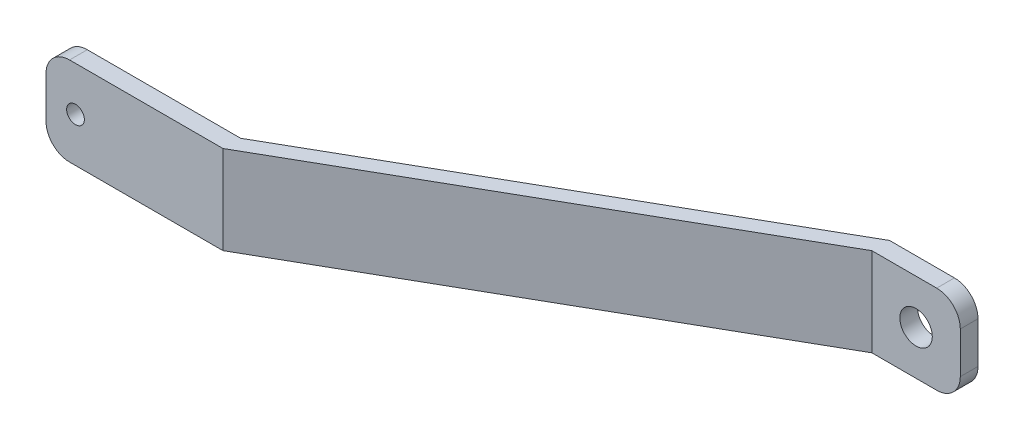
ISO-10303-21;
HEADER;
FILE_DESCRIPTION(('STEP AP214'),'2;1');
FILE_NAME('part.step','',(''),(''),'','','');
FILE_SCHEMA(('AUTOMOTIVE_DESIGN { 1 0 10303 214 1 1 1 1 }'));
ENDSEC;
DATA;
#1=APPLICATION_CONTEXT('core data for automotive mechanical design processes');
#2=APPLICATION_PROTOCOL_DEFINITION('international standard','automotive_design',2000,#1);
#3=PRODUCT_CONTEXT('',#1,'mechanical');
#4=PRODUCT('Part','Part','',(#3));
#5=PRODUCT_RELATED_PRODUCT_CATEGORY('part','',(#4));
#6=PRODUCT_DEFINITION_FORMATION('','',#4);
#7=PRODUCT_DEFINITION_CONTEXT('part definition',#1,'design');
#8=PRODUCT_DEFINITION('design','',#6,#7);
#9=PRODUCT_DEFINITION_SHAPE('','',#8);
#10=(LENGTH_UNIT() NAMED_UNIT(*) SI_UNIT(.MILLI.,.METRE.));
#11=(NAMED_UNIT(*) PLANE_ANGLE_UNIT() SI_UNIT($,.RADIAN.));
#12=(NAMED_UNIT(*) SI_UNIT($,.STERADIAN.) SOLID_ANGLE_UNIT());
#13=UNCERTAINTY_MEASURE_WITH_UNIT(LENGTH_MEASURE(1.E-05),#10,'distance_accuracy_value','');
#14=(GEOMETRIC_REPRESENTATION_CONTEXT(3) GLOBAL_UNCERTAINTY_ASSIGNED_CONTEXT((#13)) GLOBAL_UNIT_ASSIGNED_CONTEXT((#10,
#11,#12)) REPRESENTATION_CONTEXT('',''));
#15=CARTESIAN_POINT('',(0.,0.,0.));
#16=DIRECTION('',(0.,0.,1.));
#17=DIRECTION('',(1.,0.,0.));
#18=AXIS2_PLACEMENT_3D('',#15,#16,#17);
#19=CARTESIAN_POINT('',(0.,15.,0.));
#20=DIRECTION('',(0.,0.,-1.));
#21=DIRECTION('',(-1.,0.,0.));
#22=AXIS2_PLACEMENT_3D('',#19,#20,#21);
#23=PLANE('',#22);
#24=CARTESIAN_POINT('',(5.,7.5,0.));
#25=DIRECTION('',(0.,0.,1.));
#26=DIRECTION('',(1.,0.,0.));
#27=AXIS2_PLACEMENT_3D('',#24,#25,#26);
#28=CIRCLE('',#27,1.5);
#29=CARTESIAN_POINT('',(6.5,7.5,0.));
#30=VERTEX_POINT('',#29);
#31=EDGE_CURVE('E201',#30,#30,#28,.T.);
#32=ORIENTED_EDGE('',*,*,#31,.F.);
#33=EDGE_LOOP('',(#32));
#34=FACE_BOUND('',#33,.T.);
#35=DIRECTION('',(0.,-1.,0.));
#36=VECTOR('',#35,1.);
#37=CARTESIAN_POINT('',(0.,15.,0.));
#38=LINE('',#37,#36);
#39=CARTESIAN_POINT('',(0.,11.,0.));
#40=VERTEX_POINT('',#39);
#41=CARTESIAN_POINT('',(0.,4.,0.));
#42=VERTEX_POINT('',#41);
#43=EDGE_CURVE('E169',#40,#42,#38,.T.);
#44=ORIENTED_EDGE('',*,*,#43,.T.);
#45=CARTESIAN_POINT('',(4.,4.,0.));
#46=DIRECTION('',(0.,0.,-1.));
#47=DIRECTION('',(-1.,0.,0.));
#48=AXIS2_PLACEMENT_3D('',#45,#46,#47);
#49=CIRCLE('',#48,4.);
#50=CARTESIAN_POINT('',(4.,0.,0.));
#51=VERTEX_POINT('',#50);
#52=EDGE_CURVE('E215',#42,#51,#49,.F.);
#53=ORIENTED_EDGE('',*,*,#52,.T.);
#54=DIRECTION('',(1.,0.,0.));
#55=VECTOR('',#54,1.);
#56=CARTESIAN_POINT('',(0.,0.,0.));
#57=LINE('',#56,#55);
#58=CARTESIAN_POINT('',(30.,0.,0.));
#59=VERTEX_POINT('',#58);
#60=EDGE_CURVE('E148',#51,#59,#57,.T.);
#61=ORIENTED_EDGE('',*,*,#60,.T.);
#62=DIRECTION('',(0.,-1.,0.));
#63=VECTOR('',#62,1.);
#64=CARTESIAN_POINT('',(30.,15.,0.));
#65=LINE('',#64,#63);
#66=CARTESIAN_POINT('',(30.,15.,0.));
#67=VERTEX_POINT('',#66);
#68=EDGE_CURVE('E145',#67,#59,#65,.T.);
#69=ORIENTED_EDGE('',*,*,#68,.F.);
#70=DIRECTION('',(1.,0.,0.));
#71=VECTOR('',#70,1.);
#72=CARTESIAN_POINT('',(0.,15.,0.));
#73=LINE('',#72,#71);
#74=CARTESIAN_POINT('',(4.,15.,0.));
#75=VERTEX_POINT('',#74);
#76=EDGE_CURVE('E132',#75,#67,#73,.T.);
#77=ORIENTED_EDGE('',*,*,#76,.F.);
#78=CARTESIAN_POINT('',(4.,11.,0.));
#79=DIRECTION('',(0.,0.,-1.));
#80=DIRECTION('',(-1.,0.,0.));
#81=AXIS2_PLACEMENT_3D('',#78,#79,#80);
#82=CIRCLE('',#81,4.);
#83=EDGE_CURVE('E213',#75,#40,#82,.F.);
#84=ORIENTED_EDGE('',*,*,#83,.T.);
#85=EDGE_LOOP('',(#44,#53,#61,#69,#77,#84));
#86=FACE_BOUND('',#85,.T.);
#87=ADVANCED_FACE('F40',(#34,#86),#23,.F.);
#88=CARTESIAN_POINT('',(7.38461538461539,15.,12.9230769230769));
#89=DIRECTION('',(0.496138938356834,0.,0.868243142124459));
#90=DIRECTION('',(0.868243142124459,0.,-0.496138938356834));
#91=AXIS2_PLACEMENT_3D('',#88,#89,#90);
#92=PLANE('',#91);
#93=DIRECTION('',(-0.868243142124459,0.,0.496138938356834));
#94=VECTOR('',#93,1.);
#95=CARTESIAN_POINT('',(7.38461538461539,0.,12.9230769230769));
#96=LINE('',#95,#94);
#97=CARTESIAN_POINT('',(100.,0.,-40.));
#98=VERTEX_POINT('',#97);
#99=EDGE_CURVE('E171',#98,#59,#96,.T.);
#100=ORIENTED_EDGE('',*,*,#99,.F.);
#101=DIRECTION('',(0.,-1.,0.));
#102=VECTOR('',#101,1.);
#103=CARTESIAN_POINT('',(100.,15.,-40.));
#104=LINE('',#103,#102);
#105=CARTESIAN_POINT('',(100.,15.,-40.));
#106=VERTEX_POINT('',#105);
#107=EDGE_CURVE('E153',#106,#98,#104,.T.);
#108=ORIENTED_EDGE('',*,*,#107,.F.);
#109=DIRECTION('',(-0.868243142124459,0.,0.496138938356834));
#110=VECTOR('',#109,1.);
#111=CARTESIAN_POINT('',(7.38461538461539,15.,12.9230769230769));
#112=LINE('',#111,#110);
#113=EDGE_CURVE('E136',#106,#67,#112,.T.);
#114=ORIENTED_EDGE('',*,*,#113,.T.);
#115=ORIENTED_EDGE('',*,*,#68,.T.);
#116=EDGE_LOOP('',(#100,#108,#114,#115));
#117=FACE_BOUND('',#116,.T.);
#118=ADVANCED_FACE('F155',(#117),#92,.T.);
#119=CARTESIAN_POINT('',(0.,15.,-40.));
#120=DIRECTION('',(0.,0.,-1.));
#121=DIRECTION('',(-1.,0.,0.));
#122=AXIS2_PLACEMENT_3D('',#119,#120,#121);
#123=PLANE('',#122);
#124=CARTESIAN_POINT('',(107.5,7.5,-40.));
#125=DIRECTION('',(0.,0.,-1.));
#126=DIRECTION('',(-1.,0.,0.));
#127=AXIS2_PLACEMENT_3D('',#124,#125,#126);
#128=CIRCLE('',#127,2.75000000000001);
#129=CARTESIAN_POINT('',(104.75,7.5,-40.));
#130=VERTEX_POINT('',#129);
#131=EDGE_CURVE('E172',#130,#130,#128,.T.);
#132=ORIENTED_EDGE('',*,*,#131,.T.);
#133=EDGE_LOOP('',(#132));
#134=FACE_BOUND('',#133,.T.);
#135=DIRECTION('',(0.,-1.,0.));
#136=VECTOR('',#135,1.);
#137=CARTESIAN_POINT('',(115.,15.,-40.));
#138=LINE('',#137,#136);
#139=CARTESIAN_POINT('',(115.,11.,-40.));
#140=VERTEX_POINT('',#139);
#141=CARTESIAN_POINT('',(115.,4.,-40.));
#142=VERTEX_POINT('',#141);
#143=EDGE_CURVE('E194',#140,#142,#138,.T.);
#144=ORIENTED_EDGE('',*,*,#143,.F.);
#145=CARTESIAN_POINT('',(111.,11.,-40.));
#146=DIRECTION('',(0.,0.,-1.));
#147=DIRECTION('',(-1.,0.,0.));
#148=AXIS2_PLACEMENT_3D('',#145,#146,#147);
#149=CIRCLE('',#148,4.);
#150=CARTESIAN_POINT('',(111.,15.,-40.));
#151=VERTEX_POINT('',#150);
#152=EDGE_CURVE('E225',#140,#151,#149,.F.);
#153=ORIENTED_EDGE('',*,*,#152,.T.);
#154=DIRECTION('',(1.,0.,0.));
#155=VECTOR('',#154,1.);
#156=CARTESIAN_POINT('',(0.,15.,-40.));
#157=LINE('',#156,#155);
#158=EDGE_CURVE('E157',#106,#151,#157,.T.);
#159=ORIENTED_EDGE('',*,*,#158,.F.);
#160=ORIENTED_EDGE('',*,*,#107,.T.);
#161=DIRECTION('',(1.,0.,0.));
#162=VECTOR('',#161,1.);
#163=CARTESIAN_POINT('',(0.,0.,-40.));
#164=LINE('',#163,#162);
#165=CARTESIAN_POINT('',(111.,0.,-40.));
#166=VERTEX_POINT('',#165);
#167=EDGE_CURVE('E174',#98,#166,#164,.T.);
#168=ORIENTED_EDGE('',*,*,#167,.T.);
#169=CARTESIAN_POINT('',(111.,4.,-40.));
#170=DIRECTION('',(0.,0.,-1.));
#171=DIRECTION('',(-1.,0.,0.));
#172=AXIS2_PLACEMENT_3D('',#169,#170,#171);
#173=CIRCLE('',#172,4.);
#174=EDGE_CURVE('E223',#166,#142,#173,.F.);
#175=ORIENTED_EDGE('',*,*,#174,.T.);
#176=EDGE_LOOP('',(#144,#153,#159,#160,#168,#175));
#177=FACE_BOUND('',#176,.T.);
#178=ADVANCED_FACE('F239',(#134,#177),#123,.F.);
#179=CARTESIAN_POINT('',(115.,15.,5.3198186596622E-13));
#180=DIRECTION('',(1.,0.,0.));
#181=DIRECTION('',(0.,0.,-1.));
#182=AXIS2_PLACEMENT_3D('',#179,#180,#181);
#183=PLANE('',#182);
#184=DIRECTION('',(0.,-1.,0.));
#185=VECTOR('',#184,1.);
#186=CARTESIAN_POINT('',(115.,15.,-43.));
#187=LINE('',#186,#185);
#188=CARTESIAN_POINT('',(115.,11.,-43.));
#189=VERTEX_POINT('',#188);
#190=CARTESIAN_POINT('',(115.,4.,-43.));
#191=VERTEX_POINT('',#190);
#192=EDGE_CURVE('E192',#189,#191,#187,.T.);
#193=ORIENTED_EDGE('',*,*,#192,.F.);
#194=DIRECTION('',(0.,0.,1.));
#195=VECTOR('',#194,1.);
#196=CARTESIAN_POINT('',(115.,11.,5.3198186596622E-13));
#197=LINE('',#196,#195);
#198=EDGE_CURVE('E220',#189,#140,#197,.T.);
#199=ORIENTED_EDGE('',*,*,#198,.T.);
#200=ORIENTED_EDGE('',*,*,#143,.T.);
#201=DIRECTION('',(0.,0.,1.));
#202=VECTOR('',#201,1.);
#203=CARTESIAN_POINT('',(115.,4.,-43.));
#204=LINE('',#203,#202);
#205=EDGE_CURVE('E218',#142,#191,#204,.F.);
#206=ORIENTED_EDGE('',*,*,#205,.T.);
#207=EDGE_LOOP('',(#193,#199,#200,#206));
#208=FACE_BOUND('',#207,.T.);
#209=ADVANCED_FACE('F234',(#208),#183,.T.);
#210=CARTESIAN_POINT('',(0.,15.,-43.));
#211=DIRECTION('',(0.,0.,-1.));
#212=DIRECTION('',(-1.,0.,0.));
#213=AXIS2_PLACEMENT_3D('',#210,#211,#212);
#214=PLANE('',#213);
#215=CARTESIAN_POINT('',(107.5,7.5,-43.));
#216=DIRECTION('',(0.,0.,1.));
#217=DIRECTION('',(1.,0.,0.));
#218=AXIS2_PLACEMENT_3D('',#215,#216,#217);
#219=CIRCLE('',#218,2.75000000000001);
#220=CARTESIAN_POINT('',(110.25,7.5,-43.));
#221=VERTEX_POINT('',#220);
#222=EDGE_CURVE('E311',#221,#221,#219,.T.);
#223=ORIENTED_EDGE('',*,*,#222,.T.);
#224=EDGE_LOOP('',(#223));
#225=FACE_BOUND('',#224,.T.);
#226=DIRECTION('',(1.,0.,0.));
#227=VECTOR('',#226,1.);
#228=CARTESIAN_POINT('',(0.,15.,-43.));
#229=LINE('',#228,#227);
#230=CARTESIAN_POINT('',(100.,15.,-43.));
#231=VERTEX_POINT('',#230);
#232=CARTESIAN_POINT('',(111.,15.,-43.));
#233=VERTEX_POINT('',#232);
#234=EDGE_CURVE('E159',#231,#233,#229,.T.);
#235=ORIENTED_EDGE('',*,*,#234,.T.);
#236=CARTESIAN_POINT('',(111.,11.,-43.));
#237=DIRECTION('',(0.,0.,-1.));
#238=DIRECTION('',(-1.,0.,0.));
#239=AXIS2_PLACEMENT_3D('',#236,#237,#238);
#240=CIRCLE('',#239,4.);
#241=EDGE_CURVE('E48',#233,#189,#240,.T.);
#242=ORIENTED_EDGE('',*,*,#241,.T.);
#243=ORIENTED_EDGE('',*,*,#192,.T.);
#244=CARTESIAN_POINT('',(111.,4.,-43.));
#245=DIRECTION('',(0.,0.,-1.));
#246=DIRECTION('',(-1.,0.,0.));
#247=AXIS2_PLACEMENT_3D('',#244,#245,#246);
#248=CIRCLE('',#247,4.);
#249=CARTESIAN_POINT('',(111.,0.,-43.));
#250=VERTEX_POINT('',#249);
#251=EDGE_CURVE('E55',#191,#250,#248,.T.);
#252=ORIENTED_EDGE('',*,*,#251,.T.);
#253=DIRECTION('',(1.,0.,0.));
#254=VECTOR('',#253,1.);
#255=CARTESIAN_POINT('',(0.,0.,-43.));
#256=LINE('',#255,#254);
#257=CARTESIAN_POINT('',(100.,0.,-43.));
#258=VERTEX_POINT('',#257);
#259=EDGE_CURVE('E177',#258,#250,#256,.T.);
#260=ORIENTED_EDGE('',*,*,#259,.F.);
#261=DIRECTION('',(0.,-1.,0.));
#262=VECTOR('',#261,1.);
#263=CARTESIAN_POINT('',(100.,15.,-43.));
#264=LINE('',#263,#262);
#265=EDGE_CURVE('E190',#231,#258,#264,.T.);
#266=ORIENTED_EDGE('',*,*,#265,.F.);
#267=EDGE_LOOP('',(#235,#242,#243,#252,#260,#266));
#268=FACE_BOUND('',#267,.T.);
#269=ADVANCED_FACE('F230',(#225,#268),#214,.T.);
#270=CARTESIAN_POINT('',(6.09230769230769,15.,10.6615384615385));
#271=DIRECTION('',(-0.496138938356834,0.,-0.868243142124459));
#272=DIRECTION('',(-0.868243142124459,0.,0.496138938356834));
#273=AXIS2_PLACEMENT_3D('',#270,#271,#272);
#274=PLANE('',#273);
#275=DIRECTION('',(0.868243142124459,0.,-0.496138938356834));
#276=VECTOR('',#275,1.);
#277=CARTESIAN_POINT('',(6.09230769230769,0.,10.6615384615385));
#278=LINE('',#277,#276);
#279=CARTESIAN_POINT('',(30.,0.,-3.));
#280=VERTEX_POINT('',#279);
#281=EDGE_CURVE('E179',#280,#258,#278,.T.);
#282=ORIENTED_EDGE('',*,*,#281,.F.);
#283=DIRECTION('',(0.,-1.,0.));
#284=VECTOR('',#283,1.);
#285=CARTESIAN_POINT('',(30.,15.,-3.));
#286=LINE('',#285,#284);
#287=CARTESIAN_POINT('',(30.,15.,-3.));
#288=VERTEX_POINT('',#287);
#289=EDGE_CURVE('E187',#288,#280,#286,.T.);
#290=ORIENTED_EDGE('',*,*,#289,.F.);
#291=DIRECTION('',(0.868243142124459,0.,-0.496138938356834));
#292=VECTOR('',#291,1.);
#293=CARTESIAN_POINT('',(6.09230769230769,15.,10.6615384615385));
#294=LINE('',#293,#292);
#295=EDGE_CURVE('E164',#288,#231,#294,.T.);
#296=ORIENTED_EDGE('',*,*,#295,.T.);
#297=ORIENTED_EDGE('',*,*,#265,.T.);
#298=EDGE_LOOP('',(#282,#290,#296,#297));
#299=FACE_BOUND('',#298,.T.);
#300=ADVANCED_FACE('F249',(#299),#274,.T.);
#301=CARTESIAN_POINT('',(0.,15.,-3.));
#302=DIRECTION('',(0.,0.,-1.));
#303=DIRECTION('',(-1.,0.,0.));
#304=AXIS2_PLACEMENT_3D('',#301,#302,#303);
#305=PLANE('',#304);
#306=CARTESIAN_POINT('',(5.,7.5,-3.));
#307=DIRECTION('',(0.,0.,-1.));
#308=DIRECTION('',(-1.,0.,0.));
#309=AXIS2_PLACEMENT_3D('',#306,#307,#308);
#310=CIRCLE('',#309,1.5);
#311=CARTESIAN_POINT('',(3.5,7.5,-3.));
#312=VERTEX_POINT('',#311);
#313=EDGE_CURVE('E198',#312,#312,#310,.T.);
#314=ORIENTED_EDGE('',*,*,#313,.F.);
#315=EDGE_LOOP('',(#314));
#316=FACE_BOUND('',#315,.T.);
#317=DIRECTION('',(1.,0.,0.));
#318=VECTOR('',#317,1.);
#319=CARTESIAN_POINT('',(0.,0.,-3.));
#320=LINE('',#319,#318);
#321=CARTESIAN_POINT('',(4.,0.,-3.));
#322=VERTEX_POINT('',#321);
#323=EDGE_CURVE('E142',#322,#280,#320,.T.);
#324=ORIENTED_EDGE('',*,*,#323,.F.);
#325=CARTESIAN_POINT('',(4.,4.,-3.));
#326=DIRECTION('',(0.,0.,-1.));
#327=DIRECTION('',(-1.,0.,0.));
#328=AXIS2_PLACEMENT_3D('',#325,#326,#327);
#329=CIRCLE('',#328,4.);
#330=CARTESIAN_POINT('',(0.,4.,-3.));
#331=VERTEX_POINT('',#330);
#332=EDGE_CURVE('E206',#322,#331,#329,.T.);
#333=ORIENTED_EDGE('',*,*,#332,.T.);
#334=DIRECTION('',(0.,-1.,0.));
#335=VECTOR('',#334,1.);
#336=CARTESIAN_POINT('',(0.,15.,-3.));
#337=LINE('',#336,#335);
#338=CARTESIAN_POINT('',(0.,11.,-3.));
#339=VERTEX_POINT('',#338);
#340=EDGE_CURVE('E184',#339,#331,#337,.T.);
#341=ORIENTED_EDGE('',*,*,#340,.F.);
#342=CARTESIAN_POINT('',(4.,11.,-3.));
#343=DIRECTION('',(0.,0.,-1.));
#344=DIRECTION('',(-1.,0.,0.));
#345=AXIS2_PLACEMENT_3D('',#342,#343,#344);
#346=CIRCLE('',#345,4.);
#347=CARTESIAN_POINT('',(4.,15.,-3.));
#348=VERTEX_POINT('',#347);
#349=EDGE_CURVE('E204',#339,#348,#346,.T.);
#350=ORIENTED_EDGE('',*,*,#349,.T.);
#351=DIRECTION('',(1.,0.,0.));
#352=VECTOR('',#351,1.);
#353=CARTESIAN_POINT('',(0.,15.,-3.));
#354=LINE('',#353,#352);
#355=EDGE_CURVE('E167',#348,#288,#354,.T.);
#356=ORIENTED_EDGE('',*,*,#355,.T.);
#357=ORIENTED_EDGE('',*,*,#289,.T.);
#358=EDGE_LOOP('',(#324,#333,#341,#350,#356,#357));
#359=FACE_BOUND('',#358,.T.);
#360=ADVANCED_FACE('F252',(#316,#359),#305,.T.);
#361=CARTESIAN_POINT('',(0.,15.,0.));
#362=DIRECTION('',(-1.,0.,0.));
#363=DIRECTION('',(0.,0.,1.));
#364=AXIS2_PLACEMENT_3D('',#361,#362,#363);
#365=PLANE('',#364);
#366=ORIENTED_EDGE('',*,*,#340,.T.);
#367=DIRECTION('',(0.,0.,-1.));
#368=VECTOR('',#367,1.);
#369=CARTESIAN_POINT('',(0.,4.,0.));
#370=LINE('',#369,#368);
#371=EDGE_CURVE('E211',#331,#42,#370,.F.);
#372=ORIENTED_EDGE('',*,*,#371,.T.);
#373=ORIENTED_EDGE('',*,*,#43,.F.);
#374=DIRECTION('',(0.,0.,-1.));
#375=VECTOR('',#374,1.);
#376=CARTESIAN_POINT('',(0.,11.,0.));
#377=LINE('',#376,#375);
#378=EDGE_CURVE('E208',#40,#339,#377,.T.);
#379=ORIENTED_EDGE('',*,*,#378,.T.);
#380=EDGE_LOOP('',(#366,#372,#373,#379));
#381=FACE_BOUND('',#380,.T.);
#382=ADVANCED_FACE('F260',(#381),#365,.T.);
#383=CARTESIAN_POINT('',(0.,15.,0.));
#384=DIRECTION('',(0.,1.,0.));
#385=DIRECTION('',(0.,0.,1.));
#386=AXIS2_PLACEMENT_3D('',#383,#384,#385);
#387=PLANE('',#386);
#388=ORIENTED_EDGE('',*,*,#158,.T.);
#389=DIRECTION('',(0.,0.,1.));
#390=VECTOR('',#389,1.);
#391=CARTESIAN_POINT('',(111.,15.,5.13478148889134E-13));
#392=LINE('',#391,#390);
#393=EDGE_CURVE('E63',#151,#233,#392,.F.);
#394=ORIENTED_EDGE('',*,*,#393,.T.);
#395=ORIENTED_EDGE('',*,*,#234,.F.);
#396=ORIENTED_EDGE('',*,*,#295,.F.);
#397=ORIENTED_EDGE('',*,*,#355,.F.);
#398=DIRECTION('',(0.,0.,-1.));
#399=VECTOR('',#398,1.);
#400=CARTESIAN_POINT('',(4.,15.,0.));
#401=LINE('',#400,#399);
#402=EDGE_CURVE('E139',#348,#75,#401,.F.);
#403=ORIENTED_EDGE('',*,*,#402,.T.);
#404=ORIENTED_EDGE('',*,*,#76,.T.);
#405=ORIENTED_EDGE('',*,*,#113,.F.);
#406=EDGE_LOOP('',(#388,#394,#395,#396,#397,#403,#404,#405));
#407=FACE_BOUND('',#406,.T.);
#408=ADVANCED_FACE('F134',(#407),#387,.T.);
#409=CARTESIAN_POINT('',(0.,0.,0.));
#410=DIRECTION('',(0.,1.,0.));
#411=DIRECTION('',(0.,0.,1.));
#412=AXIS2_PLACEMENT_3D('',#409,#410,#411);
#413=PLANE('',#412);
#414=ORIENTED_EDGE('',*,*,#259,.T.);
#415=DIRECTION('',(0.,0.,1.));
#416=VECTOR('',#415,1.);
#417=CARTESIAN_POINT('',(111.,0.,-40.));
#418=LINE('',#417,#416);
#419=EDGE_CURVE('E11',#250,#166,#418,.T.);
#420=ORIENTED_EDGE('',*,*,#419,.T.);
#421=ORIENTED_EDGE('',*,*,#167,.F.);
#422=ORIENTED_EDGE('',*,*,#99,.T.);
#423=ORIENTED_EDGE('',*,*,#60,.F.);
#424=DIRECTION('',(0.,0.,-1.));
#425=VECTOR('',#424,1.);
#426=CARTESIAN_POINT('',(4.,0.,-3.));
#427=LINE('',#426,#425);
#428=EDGE_CURVE('E152',#51,#322,#427,.T.);
#429=ORIENTED_EDGE('',*,*,#428,.T.);
#430=ORIENTED_EDGE('',*,*,#323,.T.);
#431=ORIENTED_EDGE('',*,*,#281,.T.);
#432=EDGE_LOOP('',(#414,#420,#421,#422,#423,#429,#430,#431));
#433=FACE_BOUND('',#432,.T.);
#434=ADVANCED_FACE('F244',(#433),#413,.F.);
#435=CARTESIAN_POINT('',(5.,7.5,-43.));
#436=DIRECTION('',(0.,0.,1.));
#437=DIRECTION('',(1.,0.,0.));
#438=AXIS2_PLACEMENT_3D('',#435,#436,#437);
#439=CYLINDRICAL_SURFACE('',#438,1.5);
#440=ORIENTED_EDGE('',*,*,#313,.T.);
#441=EDGE_LOOP('',(#440));
#442=FACE_BOUND('',#441,.T.);
#443=ORIENTED_EDGE('',*,*,#31,.T.);
#444=EDGE_LOOP('',(#443));
#445=FACE_BOUND('',#444,.T.);
#446=ADVANCED_FACE('F274',(#442,#445),#439,.F.);
#447=CARTESIAN_POINT('',(107.5,7.5,-43.));
#448=DIRECTION('',(0.,0.,1.));
#449=DIRECTION('',(1.,0.,0.));
#450=AXIS2_PLACEMENT_3D('',#447,#448,#449);
#451=CYLINDRICAL_SURFACE('',#450,2.75000000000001);
#452=ORIENTED_EDGE('',*,*,#222,.F.);
#453=EDGE_LOOP('',(#452));
#454=FACE_BOUND('',#453,.T.);
#455=ORIENTED_EDGE('',*,*,#131,.F.);
#456=EDGE_LOOP('',(#455));
#457=FACE_BOUND('',#456,.T.);
#458=ADVANCED_FACE('F266',(#454,#457),#451,.F.);
#459=CARTESIAN_POINT('',(4.,4.,0.));
#460=DIRECTION('',(0.,0.,1.));
#461=DIRECTION('',(1.,0.,0.));
#462=AXIS2_PLACEMENT_3D('',#459,#460,#461);
#463=CYLINDRICAL_SURFACE('',#462,4.);
#464=ORIENTED_EDGE('',*,*,#52,.F.);
#465=ORIENTED_EDGE('',*,*,#371,.F.);
#466=ORIENTED_EDGE('',*,*,#332,.F.);
#467=ORIENTED_EDGE('',*,*,#428,.F.);
#468=EDGE_LOOP('',(#464,#465,#466,#467));
#469=FACE_BOUND('',#468,.T.);
#470=ADVANCED_FACE('F263',(#469),#463,.T.);
#471=CARTESIAN_POINT('',(4.,11.,0.));
#472=DIRECTION('',(0.,0.,-1.));
#473=DIRECTION('',(-1.,0.,0.));
#474=AXIS2_PLACEMENT_3D('',#471,#472,#473);
#475=CYLINDRICAL_SURFACE('',#474,4.);
#476=ORIENTED_EDGE('',*,*,#83,.F.);
#477=ORIENTED_EDGE('',*,*,#402,.F.);
#478=ORIENTED_EDGE('',*,*,#349,.F.);
#479=ORIENTED_EDGE('',*,*,#378,.F.);
#480=EDGE_LOOP('',(#476,#477,#478,#479));
#481=FACE_BOUND('',#480,.T.);
#482=ADVANCED_FACE('F255',(#481),#475,.T.);
#483=CARTESIAN_POINT('',(111.,11.,5.13478148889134E-13));
#484=DIRECTION('',(0.,0.,1.));
#485=DIRECTION('',(1.,0.,0.));
#486=AXIS2_PLACEMENT_3D('',#483,#484,#485);
#487=CYLINDRICAL_SURFACE('',#486,4.);
#488=ORIENTED_EDGE('',*,*,#241,.F.);
#489=ORIENTED_EDGE('',*,*,#393,.F.);
#490=ORIENTED_EDGE('',*,*,#152,.F.);
#491=ORIENTED_EDGE('',*,*,#198,.F.);
#492=EDGE_LOOP('',(#488,#489,#490,#491));
#493=FACE_BOUND('',#492,.T.);
#494=ADVANCED_FACE('F237',(#493),#487,.T.);
#495=CARTESIAN_POINT('',(111.,4.,5.13478148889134E-13));
#496=DIRECTION('',(0.,0.,-1.));
#497=DIRECTION('',(-1.,0.,0.));
#498=AXIS2_PLACEMENT_3D('',#495,#496,#497);
#499=CYLINDRICAL_SURFACE('',#498,4.);
#500=ORIENTED_EDGE('',*,*,#251,.F.);
#501=ORIENTED_EDGE('',*,*,#205,.F.);
#502=ORIENTED_EDGE('',*,*,#174,.F.);
#503=ORIENTED_EDGE('',*,*,#419,.F.);
#504=EDGE_LOOP('',(#500,#501,#502,#503));
#505=FACE_BOUND('',#504,.T.);
#506=ADVANCED_FACE('F42',(#505),#499,.T.);
#507=CLOSED_SHELL('',(#87,#118,#178,#209,#269,#300,#360,#382,#408,#434,#446,#458,#470,#482,#494,#506));
#508=MANIFOLD_SOLID_BREP('B2',#507);
#509=ADVANCED_BREP_SHAPE_REPRESENTATION('',(#18,#508),#14);
#510=SHAPE_DEFINITION_REPRESENTATION(#9,#509);
ENDSEC;
END-ISO-10303-21;
